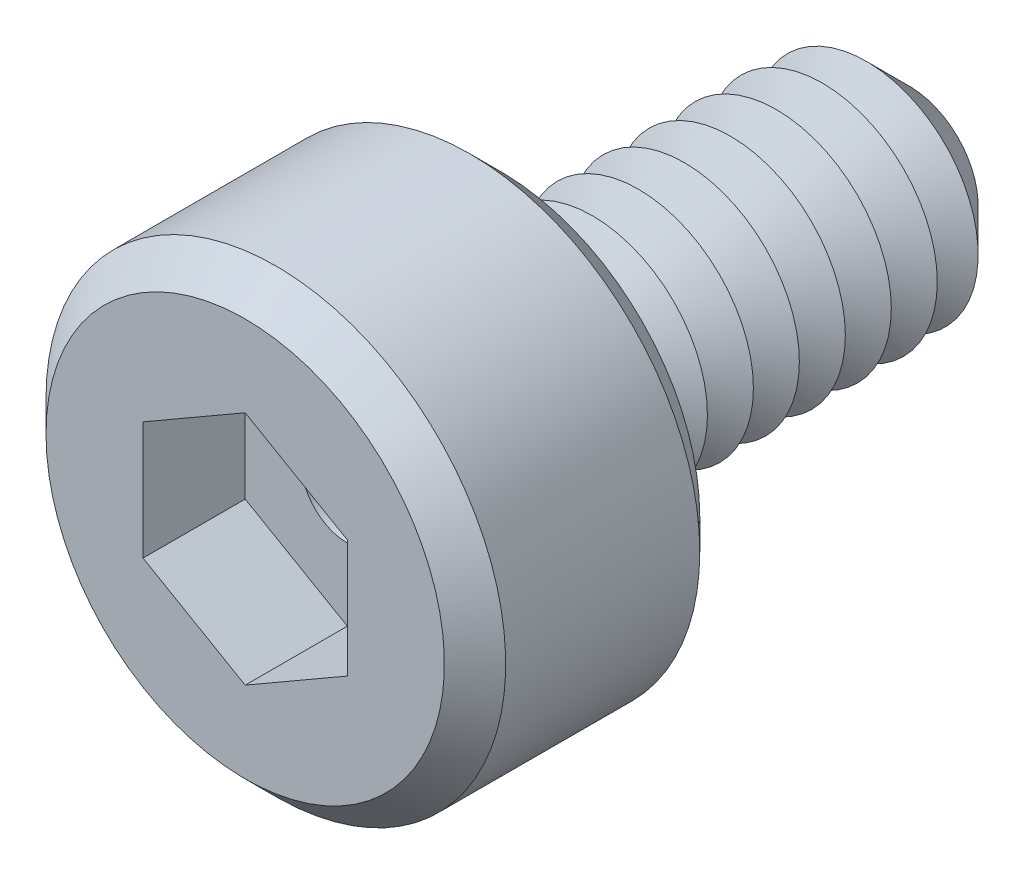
from build123d import *

# Parameters (mm, degrees)
SKETCH1_R           = 2.25
BOSS_EXTRUDE1_DEPTH = 2.5
SKETCH2_R           = 1.125
BOSS_EXTRUDE2_DEPTH = 4
CHAMFER1_SIZE       = 0.45
LPATTERN1_COUNT     = 8
LPATTERN1_PITCH     = 0.45
CUT_EXTRUDE1_DEPTH  = 1
SKETCH6_R           = 0.45
CUT_EXTRUDE2_DEPTH  = 5.5
CHAMFER2_SIZE       = 0.3


with BuildPart() as part:
    # Sketch1 → Boss-Extrude1 (new body)
    with BuildSketch(Plane.XY):
        Circle(SKETCH1_R)
    extrude(amount=BOSS_EXTRUDE1_DEPTH)

    # Sketch2 → Boss-Extrude2 (add)
    with BuildSketch(Plane(origin=(0, 0, 0), x_dir=(-1, 0, 0), z_dir=(0, 0, -1))):
        Circle(SKETCH2_R)
    extrude(amount=BOSS_EXTRUDE2_DEPTH)

    # Chamfer1
    chamfer1_edges = [part.edges().sort_by_distance(p)[0] for p in [
        (1.125, 0, -4),
    ]]
    chamfer(chamfer1_edges, length=CHAMFER1_SIZE)

    # Sketch4 → Cut-Revolve1 (revolve, cut)
    with BuildSketch(Plane(origin=(0, 0, 0), x_dir=(0, 0, -1), z_dir=(1, 0, 0)), mode=Mode.PRIVATE) as cut_revolve1_sk:
        Polygon((0, 1.125), (0.225, 0.735288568), (0.45, 1.125), align=None)
    cut_revolve1 = revolve(cut_revolve1_sk.sketch.rotate(Axis((0, 0, 2.512122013), (0, 0, -1)), 90), axis=Axis((0, 0, 2.512122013), (0, 0, -1)), mode=Mode.SUBTRACT)

    # LPattern1: Cut-Revolve1 ×8
    with Locations(*[(0, 0, -i * LPATTERN1_PITCH) for i in range(1, LPATTERN1_COUNT)]):
        add(cut_revolve1, mode=Mode.SUBTRACT)

    # Sketch5 → Cut-Extrude1 (cut)
    with BuildSketch(Plane.XY.offset(2.5)):
        Polygon((0, 1.154700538), (-1, 0.577350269), (-1, -0.577350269), (0, -1.154700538), (1, -0.577350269), (1, 0.577350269), align=None)
    extrude(amount=-CUT_EXTRUDE1_DEPTH, mode=Mode.SUBTRACT)

    # Sketch6 → Cut-Extrude2 (cut)
    with BuildSketch(Plane.XY.offset(1.5)):
        Circle(SKETCH6_R)
    extrude(amount=-CUT_EXTRUDE2_DEPTH, mode=Mode.SUBTRACT)

    # Chamfer2
    chamfer2_edges = [part.edges().sort_by_distance(p)[0] for p in [
        (-2.25, 0, 0),
        (-2.25, 0, 2.5),
    ]]
    chamfer(chamfer2_edges, length=CHAMFER2_SIZE)


solid = part.part
